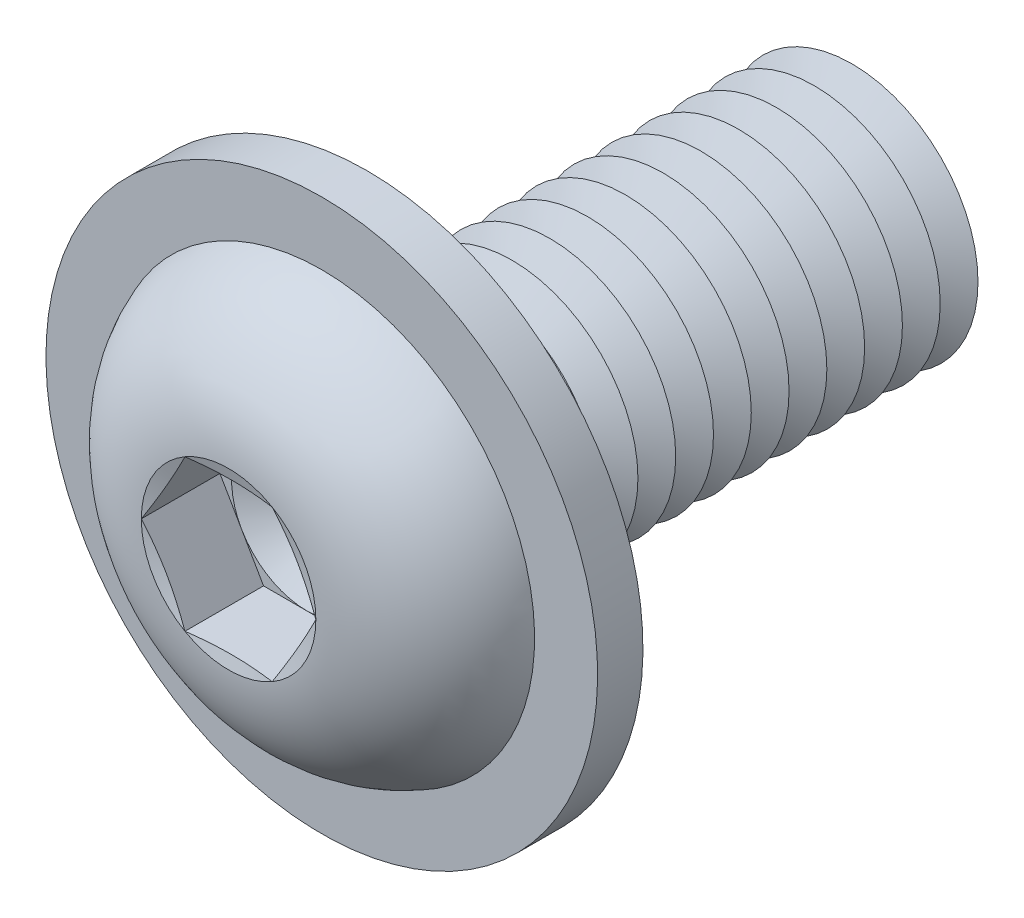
from build123d import *

# Parameters (mm, degrees)
FILLET1_R           = 0.75
LPATTERN1_COUNT     = 13
LPATTERN1_PITCH     = 1.5
CUT_EXTRUDE1_DEPTH  = 3.12
SKETCH5_R           = 10.95
SKETCH5_R_2         = 5.75
BOSS_EXTRUDE1_DEPTH = 1.8


with BuildPart() as part:
    # Sketch1 → Revolve1 (revolve)
    with BuildSketch(Plane(origin=(0, 0, 0), x_dir=(0, 0, -1), z_dir=(1, 0, 0)), mode=Mode.PRIVATE) as revolve1_sk:
        with BuildLine():
            Line((0, 5), (0, 8.75))
            ThreePointArc((0, 8.75), (-3.814142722, 7.21429474), (-5.5, 3.4641))
            Line((-5.5, 3.4641), (-5.035898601, 1.73205))
            Line((-5.035898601, 1.73205), (-5.5, 1.73205))
            Line((-5.5, 1.73205), (-5.5, 0))
            Line((-5.5, 0), (20, 0))
            Line((20, 0), (20, 5))
            Line((20, 5), (0, 5))
        make_face()
    revolve(revolve1_sk.sketch.rotate(Axis((0, 0, -20), (0, 0, 1)), 90), axis=Axis((0, 0, -20), (0, 0, 1)))

    # Fillet1
    fillet1_edges = [part.edges().sort_by_distance(p)[0] for p in [
        (5, 0, 0),
    ]]
    fillet(fillet1_edges, radius=FILLET1_R)

    # Sketch2 → Cut-Revolve1 (revolve, cut)
    with BuildSketch(Plane(origin=(0, 0, 0), x_dir=(0, 0, -1), z_dir=(1, 0, 0)), mode=Mode.PRIVATE) as cut_revolve1_sk:
        Polygon((19.25, 5), (20.75, 5), (20, 3.700961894), align=None)
    cut_revolve1 = revolve(cut_revolve1_sk.sketch.rotate(Axis((0, 0, -20), (0, 0, -1)), 270), axis=Axis((0, 0, -20), (0, 0, -1)), mode=Mode.SUBTRACT)

    # LPattern1: Cut-Revolve1 ×13
    with Locations(*[(0, 0, i * LPATTERN1_PITCH) for i in range(1, LPATTERN1_COUNT)]):
        add(cut_revolve1, mode=Mode.SUBTRACT)

    # Sketch3 → Cut-Extrude1 (cut)
    with BuildSketch(Plane.XY.offset(5.5)):
        Polygon((1.73205, 2.999998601), (-1.73205, 2.999998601), (-3.4641, 0), (-1.73205, -2.999998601), (1.73205, -2.999998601), (3.4641, 0), align=None)
    extrude(amount=-CUT_EXTRUDE1_DEPTH, mode=Mode.SUBTRACT)

    # Cut-Extrude2 cone 1 section (on through the dimple's axis) → Cut-Extrude2 (revolve, cut)
    with BuildSketch(Plane(origin=(0, 0, 2.38), x_dir=(0, -1, 0), z_dir=(1, 0, 0))):
        Polygon((0, 0), (2.999998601, 0), (0, 1.73205), align=None)
    revolve(axis=Axis((0, 0, 2.38), (0, 0, -1)), mode=Mode.SUBTRACT)

    # Sketch5 → Boss-Extrude1 (add)
    with BuildSketch(Plane(origin=(0, 0, 0), x_dir=(-1, 0, 0), z_dir=(0, 0, -1))):
        with Locations(Location((0, 0, 0), (0, 0, 90))):
            Circle(SKETCH5_R)
        Circle(SKETCH5_R_2, mode=Mode.SUBTRACT)
    extrude(amount=-BOSS_EXTRUDE1_DEPTH)


solid = part.part
